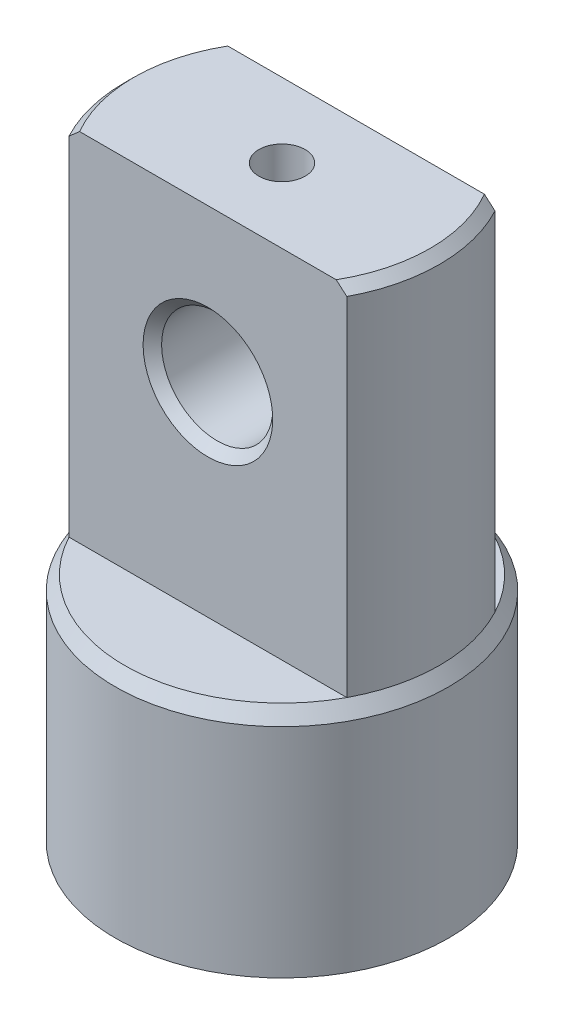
ISO-10303-21;
HEADER;
FILE_DESCRIPTION(('STEP AP214'),'2;1');
FILE_NAME('part.step','',(''),(''),'','','');
FILE_SCHEMA(('AUTOMOTIVE_DESIGN { 1 0 10303 214 1 1 1 1 }'));
ENDSEC;
DATA;
#1=APPLICATION_CONTEXT('core data for automotive mechanical design processes');
#2=APPLICATION_PROTOCOL_DEFINITION('international standard','automotive_design',2000,#1);
#3=PRODUCT_CONTEXT('',#1,'mechanical');
#4=PRODUCT('Part','Part','',(#3));
#5=PRODUCT_RELATED_PRODUCT_CATEGORY('part','',(#4));
#6=PRODUCT_DEFINITION_FORMATION('','',#4);
#7=PRODUCT_DEFINITION_CONTEXT('part definition',#1,'design');
#8=PRODUCT_DEFINITION('design','',#6,#7);
#9=PRODUCT_DEFINITION_SHAPE('','',#8);
#10=(LENGTH_UNIT() NAMED_UNIT(*) SI_UNIT(.MILLI.,.METRE.));
#11=(NAMED_UNIT(*) PLANE_ANGLE_UNIT() SI_UNIT($,.RADIAN.));
#12=(NAMED_UNIT(*) SI_UNIT($,.STERADIAN.) SOLID_ANGLE_UNIT());
#13=UNCERTAINTY_MEASURE_WITH_UNIT(LENGTH_MEASURE(1.E-05),#10,'distance_accuracy_value','');
#14=(GEOMETRIC_REPRESENTATION_CONTEXT(3) GLOBAL_UNCERTAINTY_ASSIGNED_CONTEXT((#13)) GLOBAL_UNIT_ASSIGNED_CONTEXT((#10,
#11,#12)) REPRESENTATION_CONTEXT('',''));
#15=CARTESIAN_POINT('',(0.,0.,0.));
#16=DIRECTION('',(0.,0.,1.));
#17=DIRECTION('',(1.,0.,0.));
#18=AXIS2_PLACEMENT_3D('',#15,#16,#17);
#19=CARTESIAN_POINT('',(-16.1245154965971,25.,8.));
#20=DIRECTION('',(0.,0.,-1.));
#21=DIRECTION('',(-1.,0.,0.));
#22=AXIS2_PLACEMENT_3D('',#19,#20,#21);
#23=PLANE('',#22);
#24=CARTESIAN_POINT('',(0.,47.,8.));
#25=DIRECTION('',(0.,0.,-1.));
#26=DIRECTION('',(-1.,0.,0.));
#27=AXIS2_PLACEMENT_3D('',#24,#25,#26);
#28=CIRCLE('',#27,6.99999999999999);
#29=CARTESIAN_POINT('',(-6.99999999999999,47.,8.));
#30=VERTEX_POINT('',#29);
#31=EDGE_CURVE('E11',#30,#30,#28,.T.);
#32=ORIENTED_EDGE('',*,*,#31,.T.);
#33=EDGE_LOOP('',(#32));
#34=FACE_BOUND('',#33,.T.);
#35=DIRECTION('',(0.,-1.,0.));
#36=VECTOR('',#35,1.);
#37=CARTESIAN_POINT('',(15.,0.,8.));
#38=LINE('',#37,#36);
#39=CARTESIAN_POINT('',(15.,25.,8.));
#40=VERTEX_POINT('',#39);
#41=CARTESIAN_POINT('',(15.,62.5,8.));
#42=VERTEX_POINT('',#41);
#43=EDGE_CURVE('E101',#40,#42,#38,.F.);
#44=ORIENTED_EDGE('',*,*,#43,.T.);
#45=CARTESIAN_POINT('',(15.,62.5,8.));
#46=CARTESIAN_POINT('',(14.9050732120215,62.5837587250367,8.));
#47=CARTESIAN_POINT('',(14.8100592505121,62.6674187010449,8.));
#48=CARTESIAN_POINT('',(14.6198485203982,62.8345295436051,8.));
#49=CARTESIAN_POINT('',(14.5246517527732,62.917980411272,8.));
#50=CARTESIAN_POINT('',(14.3340658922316,63.0846623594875,8.));
#51=CARTESIAN_POINT('',(14.2386767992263,63.1678934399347,8.));
#52=CARTESIAN_POINT('',(14.0476959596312,63.3341237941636,8.));
#53=CARTESIAN_POINT('',(13.9521042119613,63.4171230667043,8.));
#54=CARTESIAN_POINT('',(13.856406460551,63.5,8.));
#55=B_SPLINE_CURVE_WITH_KNOTS('',3,(#45,#46,#47,#48,#49,#50,#51,#52,#53,#54),.UNSPECIFIED.,.F.,
.F.,(4,2,2,2,4),(0.,0.379788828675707,0.759575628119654,1.13936260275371,1.51915160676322),.UNSPECIFIED.);
#56=CARTESIAN_POINT('',(13.856406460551,63.5,8.));
#57=VERTEX_POINT('',#56);
#58=EDGE_CURVE('E143',#42,#57,#55,.T.);
#59=ORIENTED_EDGE('',*,*,#58,.T.);
#60=DIRECTION('',(-1.,0.,0.));
#61=VECTOR('',#60,1.);
#62=CARTESIAN_POINT('',(17.,63.5,8.));
#63=LINE('',#62,#61);
#64=CARTESIAN_POINT('',(-13.856406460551,63.5,8.));
#65=VERTEX_POINT('',#64);
#66=EDGE_CURVE('E132',#57,#65,#63,.T.);
#67=ORIENTED_EDGE('',*,*,#66,.T.);
#68=CARTESIAN_POINT('',(-13.856406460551,63.5,8.));
#69=CARTESIAN_POINT('',(-13.9521042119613,63.4171230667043,8.));
#70=CARTESIAN_POINT('',(-14.0476959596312,63.3341237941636,8.));
#71=CARTESIAN_POINT('',(-14.2386767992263,63.1678934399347,8.));
#72=CARTESIAN_POINT('',(-14.3340658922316,63.0846623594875,8.));
#73=CARTESIAN_POINT('',(-14.5246517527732,62.917980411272,8.));
#74=CARTESIAN_POINT('',(-14.6198485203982,62.8345295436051,8.));
#75=CARTESIAN_POINT('',(-14.8100592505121,62.6674187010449,8.));
#76=CARTESIAN_POINT('',(-14.9050732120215,62.5837587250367,8.));
#77=CARTESIAN_POINT('',(-15.,62.5,8.));
#78=B_SPLINE_CURVE_WITH_KNOTS('',3,(#68,#69,#70,#71,#72,#73,#74,#75,#76,#77),.UNSPECIFIED.,.F.,
.F.,(4,2,2,2,4),(0.,0.379789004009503,0.759575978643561,1.13936277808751,1.51915160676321),.UNSPECIFIED.);
#79=CARTESIAN_POINT('',(-15.,62.5,8.));
#80=VERTEX_POINT('',#79);
#81=EDGE_CURVE('E136',#65,#80,#78,.T.);
#82=ORIENTED_EDGE('',*,*,#81,.T.);
#83=DIRECTION('',(0.,-1.,0.));
#84=VECTOR('',#83,1.);
#85=CARTESIAN_POINT('',(-15.,0.,8.));
#86=LINE('',#85,#84);
#87=CARTESIAN_POINT('',(-15.,25.,8.));
#88=VERTEX_POINT('',#87);
#89=EDGE_CURVE('E103',#80,#88,#86,.T.);
#90=ORIENTED_EDGE('',*,*,#89,.T.);
#91=DIRECTION('',(-1.,0.,0.));
#92=VECTOR('',#91,1.);
#93=CARTESIAN_POINT('',(-16.1245154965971,25.,8.));
#94=LINE('',#93,#92);
#95=EDGE_CURVE('E91',#40,#88,#94,.T.);
#96=ORIENTED_EDGE('',*,*,#95,.F.);
#97=EDGE_LOOP('',(#44,#59,#67,#82,#90,#96));
#98=FACE_BOUND('',#97,.T.);
#99=ADVANCED_FACE('F32',(#34,#98),#23,.F.);
#100=CARTESIAN_POINT('',(0.,0.,0.));
#101=DIRECTION('',(0.,-1.,0.));
#102=DIRECTION('',(1.,0.,0.));
#103=AXIS2_PLACEMENT_3D('',#100,#101,#102);
#104=CYLINDRICAL_SURFACE('',#103,17.);
#105=DIRECTION('',(0.,-1.,0.));
#106=VECTOR('',#105,1.);
#107=CARTESIAN_POINT('',(15.,0.,-8.));
#108=LINE('',#107,#106);
#109=CARTESIAN_POINT('',(15.,62.5,-8.));
#110=VERTEX_POINT('',#109);
#111=CARTESIAN_POINT('',(15.,25.,-8.));
#112=VERTEX_POINT('',#111);
#113=EDGE_CURVE('E324',#110,#112,#108,.T.);
#114=ORIENTED_EDGE('',*,*,#113,.F.);
#115=CARTESIAN_POINT('',(0.,62.5,0.));
#116=DIRECTION('',(0.,1.,0.));
#117=DIRECTION('',(-1.,0.,0.));
#118=AXIS2_PLACEMENT_3D('',#115,#116,#117);
#119=CIRCLE('',#118,17.);
#120=EDGE_CURVE('E113',#110,#42,#119,.F.);
#121=ORIENTED_EDGE('',*,*,#120,.T.);
#122=ORIENTED_EDGE('',*,*,#43,.F.);
#123=CARTESIAN_POINT('',(0.,25.,0.));
#124=DIRECTION('',(0.,-1.,0.));
#125=DIRECTION('',(1.,0.,0.));
#126=AXIS2_PLACEMENT_3D('',#123,#124,#125);
#127=CIRCLE('',#126,17.);
#128=EDGE_CURVE('E95',#112,#40,#127,.T.);
#129=ORIENTED_EDGE('',*,*,#128,.F.);
#130=EDGE_LOOP('',(#114,#121,#122,#129));
#131=FACE_BOUND('',#130,.T.);
#132=ADVANCED_FACE('F110',(#131),#104,.T.);
#133=CARTESIAN_POINT('',(0.,0.,0.));
#134=DIRECTION('',(0.,-1.,0.));
#135=DIRECTION('',(1.,0.,0.));
#136=AXIS2_PLACEMENT_3D('',#133,#134,#135);
#137=PLANE('',#136);
#138=CARTESIAN_POINT('',(0.,0.,0.));
#139=DIRECTION('',(0.,-1.,0.));
#140=DIRECTION('',(1.,0.,0.));
#141=AXIS2_PLACEMENT_3D('',#138,#139,#140);
#142=CIRCLE('',#141,18.);
#143=CARTESIAN_POINT('',(18.,0.,0.));
#144=VERTEX_POINT('',#143);
#145=EDGE_CURVE('E127',#144,#144,#142,.T.);
#146=ORIENTED_EDGE('',*,*,#145,.T.);
#147=EDGE_LOOP('',(#146));
#148=FACE_BOUND('',#147,.T.);
#149=ADVANCED_FACE('F188',(#148),#137,.T.);
#150=CARTESIAN_POINT('',(0.,0.,0.));
#151=DIRECTION('',(0.,-1.,0.));
#152=DIRECTION('',(1.,0.,0.));
#153=AXIS2_PLACEMENT_3D('',#150,#151,#152);
#154=CYLINDRICAL_SURFACE('',#153,18.);
#155=CARTESIAN_POINT('',(0.,23.5,0.));
#156=DIRECTION('',(0.,-1.,0.));
#157=DIRECTION('',(1.,0.,0.));
#158=AXIS2_PLACEMENT_3D('',#155,#156,#157);
#159=CIRCLE('',#158,18.);
#160=CARTESIAN_POINT('',(18.,23.5,0.));
#161=VERTEX_POINT('',#160);
#162=EDGE_CURVE('E120',#161,#161,#159,.T.);
#163=ORIENTED_EDGE('',*,*,#162,.T.);
#164=EDGE_LOOP('',(#163));
#165=FACE_BOUND('',#164,.T.);
#166=ORIENTED_EDGE('',*,*,#145,.F.);
#167=EDGE_LOOP('',(#166));
#168=FACE_BOUND('',#167,.T.);
#169=ADVANCED_FACE('F192',(#165,#168),#154,.T.);
#170=CARTESIAN_POINT('',(0.,23.5,0.));
#171=DIRECTION('',(0.,-1.,0.));
#172=DIRECTION('',(1.,0.,0.));
#173=AXIS2_PLACEMENT_3D('',#170,#171,#172);
#174=CONICAL_SURFACE('',#173,18.,0.588002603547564);
#175=CARTESIAN_POINT('',(-15.,25.,-8.));
#176=VERTEX_POINT('',#175);
#177=EDGE_CURVE('E119',#176,#112,#127,.T.);
#178=ORIENTED_EDGE('',*,*,#177,.T.);
#179=ORIENTED_EDGE('',*,*,#128,.T.);
#180=EDGE_CURVE('E88',#40,#88,#127,.T.);
#181=ORIENTED_EDGE('',*,*,#180,.T.);
#182=EDGE_CURVE('E96',#88,#176,#127,.T.);
#183=ORIENTED_EDGE('',*,*,#182,.T.);
#184=EDGE_LOOP('',(#178,#179,#181,#183));
#185=FACE_BOUND('',#184,.T.);
#186=ORIENTED_EDGE('',*,*,#162,.F.);
#187=EDGE_LOOP('',(#186));
#188=FACE_BOUND('',#187,.T.);
#189=ADVANCED_FACE('F116',(#185,#188),#174,.T.);
#190=ORIENTED_EDGE('',*,*,#89,.F.);
#191=CARTESIAN_POINT('',(0.,62.5,0.));
#192=DIRECTION('',(0.,1.,0.));
#193=DIRECTION('',(-1.,0.,0.));
#194=AXIS2_PLACEMENT_3D('',#191,#192,#193);
#195=CIRCLE('',#194,17.);
#196=CARTESIAN_POINT('',(-15.,62.5,-8.));
#197=VERTEX_POINT('',#196);
#198=EDGE_CURVE('E181',#80,#197,#195,.F.);
#199=ORIENTED_EDGE('',*,*,#198,.T.);
#200=DIRECTION('',(0.,-1.,0.));
#201=VECTOR('',#200,1.);
#202=CARTESIAN_POINT('',(-15.,0.,-8.));
#203=LINE('',#202,#201);
#204=EDGE_CURVE('E123',#176,#197,#203,.F.);
#205=ORIENTED_EDGE('',*,*,#204,.F.);
#206=ORIENTED_EDGE('',*,*,#182,.F.);
#207=EDGE_LOOP('',(#190,#199,#205,#206));
#208=FACE_BOUND('',#207,.T.);
#209=ADVANCED_FACE('F198',(#208),#104,.T.);
#210=CARTESIAN_POINT('',(17.,63.5,0.));
#211=DIRECTION('',(0.,1.,0.));
#212=DIRECTION('',(-1.,0.,0.));
#213=AXIS2_PLACEMENT_3D('',#210,#211,#212);
#214=PLANE('',#213);
#215=CARTESIAN_POINT('',(0.,63.5,0.));
#216=DIRECTION('',(0.,1.,0.));
#217=DIRECTION('',(0.,0.,1.));
#218=AXIS2_PLACEMENT_3D('',#215,#216,#217);
#219=CIRCLE('',#218,2.5);
#220=CARTESIAN_POINT('',(0.,63.5,2.5));
#221=VERTEX_POINT('',#220);
#222=EDGE_CURVE('E320',#221,#221,#219,.T.);
#223=ORIENTED_EDGE('',*,*,#222,.F.);
#224=EDGE_LOOP('',(#223));
#225=FACE_BOUND('',#224,.T.);
#226=ORIENTED_EDGE('',*,*,#66,.F.);
#227=CARTESIAN_POINT('',(0.,63.5,0.));
#228=DIRECTION('',(0.,1.,0.));
#229=DIRECTION('',(-1.,0.,0.));
#230=AXIS2_PLACEMENT_3D('',#227,#228,#229);
#231=CIRCLE('',#230,16.);
#232=CARTESIAN_POINT('',(13.856406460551,63.5,-8.));
#233=VERTEX_POINT('',#232);
#234=EDGE_CURVE('E55',#57,#233,#231,.T.);
#235=ORIENTED_EDGE('',*,*,#234,.T.);
#236=DIRECTION('',(1.,0.,0.));
#237=VECTOR('',#236,1.);
#238=CARTESIAN_POINT('',(17.,63.5,-8.));
#239=LINE('',#238,#237);
#240=CARTESIAN_POINT('',(-13.856406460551,63.5,-8.));
#241=VERTEX_POINT('',#240);
#242=EDGE_CURVE('E130',#241,#233,#239,.T.);
#243=ORIENTED_EDGE('',*,*,#242,.F.);
#244=CARTESIAN_POINT('',(0.,63.5,0.));
#245=DIRECTION('',(0.,1.,0.));
#246=DIRECTION('',(-1.,0.,0.));
#247=AXIS2_PLACEMENT_3D('',#244,#245,#246);
#248=CIRCLE('',#247,16.);
#249=EDGE_CURVE('E343',#241,#65,#248,.T.);
#250=ORIENTED_EDGE('',*,*,#249,.T.);
#251=EDGE_LOOP('',(#226,#235,#243,#250));
#252=FACE_BOUND('',#251,.T.);
#253=ADVANCED_FACE('F166',(#225,#252),#214,.T.);
#254=CARTESIAN_POINT('',(-16.1245154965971,25.,-8.));
#255=DIRECTION('',(0.,0.,1.));
#256=DIRECTION('',(1.,0.,0.));
#257=AXIS2_PLACEMENT_3D('',#254,#255,#256);
#258=PLANE('',#257);
#259=CARTESIAN_POINT('',(0.,47.,-8.));
#260=DIRECTION('',(0.,0.,1.));
#261=DIRECTION('',(1.,0.,0.));
#262=AXIS2_PLACEMENT_3D('',#259,#260,#261);
#263=CIRCLE('',#262,6.99999999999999);
#264=CARTESIAN_POINT('',(6.99999999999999,47.,-8.));
#265=VERTEX_POINT('',#264);
#266=EDGE_CURVE('E330',#265,#265,#263,.T.);
#267=ORIENTED_EDGE('',*,*,#266,.T.);
#268=EDGE_LOOP('',(#267));
#269=FACE_BOUND('',#268,.T.);
#270=ORIENTED_EDGE('',*,*,#242,.T.);
#271=CARTESIAN_POINT('',(13.856406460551,63.5,-8.));
#272=CARTESIAN_POINT('',(13.9521042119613,63.4171230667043,-8.));
#273=CARTESIAN_POINT('',(14.0476959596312,63.3341237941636,-8.));
#274=CARTESIAN_POINT('',(14.2386767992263,63.1678934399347,-8.));
#275=CARTESIAN_POINT('',(14.3340658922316,63.0846623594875,-8.));
#276=CARTESIAN_POINT('',(14.5246517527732,62.917980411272,-8.));
#277=CARTESIAN_POINT('',(14.6198485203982,62.8345295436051,-8.));
#278=CARTESIAN_POINT('',(14.8100592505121,62.6674187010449,-8.));
#279=CARTESIAN_POINT('',(14.9050732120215,62.5837587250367,-8.));
#280=CARTESIAN_POINT('',(15.,62.5,-8.));
#281=B_SPLINE_CURVE_WITH_KNOTS('',3,(#271,#272,#273,#274,#275,#276,#277,#278,#279,#280),
.UNSPECIFIED.,.F.,.F.,(4,2,2,2,4),(0.,0.379789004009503,0.759575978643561,1.13936277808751,
1.51915160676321),.UNSPECIFIED.);
#282=EDGE_CURVE('E176',#233,#110,#281,.T.);
#283=ORIENTED_EDGE('',*,*,#282,.T.);
#284=ORIENTED_EDGE('',*,*,#113,.T.);
#285=DIRECTION('',(1.,0.,0.));
#286=VECTOR('',#285,1.);
#287=CARTESIAN_POINT('',(-16.1245154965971,25.,-8.));
#288=LINE('',#287,#286);
#289=EDGE_CURVE('E114',#176,#112,#288,.T.);
#290=ORIENTED_EDGE('',*,*,#289,.F.);
#291=ORIENTED_EDGE('',*,*,#204,.T.);
#292=CARTESIAN_POINT('',(-15.,62.5,-8.));
#293=CARTESIAN_POINT('',(-14.9050732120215,62.5837587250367,-8.));
#294=CARTESIAN_POINT('',(-14.8100592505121,62.6674187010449,-8.));
#295=CARTESIAN_POINT('',(-14.6198485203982,62.8345295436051,-8.));
#296=CARTESIAN_POINT('',(-14.5246517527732,62.917980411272,-8.));
#297=CARTESIAN_POINT('',(-14.3340658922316,63.0846623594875,-8.));
#298=CARTESIAN_POINT('',(-14.2386767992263,63.1678934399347,-8.));
#299=CARTESIAN_POINT('',(-14.0476959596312,63.3341237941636,-8.));
#300=CARTESIAN_POINT('',(-13.9521042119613,63.4171230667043,-8.));
#301=CARTESIAN_POINT('',(-13.856406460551,63.5,-8.));
#302=B_SPLINE_CURVE_WITH_KNOTS('',3,(#292,#293,#294,#295,#296,#297,#298,#299,#300,#301),
.UNSPECIFIED.,.F.,.F.,(4,2,2,2,4),(0.,0.379788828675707,0.759575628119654,1.13936260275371,
1.51915160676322),.UNSPECIFIED.);
#303=EDGE_CURVE('E47',#197,#241,#302,.T.);
#304=ORIENTED_EDGE('',*,*,#303,.T.);
#305=EDGE_LOOP('',(#270,#283,#284,#290,#291,#304));
#306=FACE_BOUND('',#305,.T.);
#307=ADVANCED_FACE('F161',(#269,#306),#258,.F.);
#308=CARTESIAN_POINT('',(0.,25.,0.));
#309=DIRECTION('',(0.,1.,0.));
#310=DIRECTION('',(0.,0.,1.));
#311=AXIS2_PLACEMENT_3D('',#308,#309,#310);
#312=PLANE('',#311);
#313=ORIENTED_EDGE('',*,*,#289,.T.);
#314=ORIENTED_EDGE('',*,*,#177,.F.);
#315=EDGE_LOOP('',(#313,#314));
#316=FACE_BOUND('',#315,.T.);
#317=ADVANCED_FACE('F157',(#316),#312,.T.);
#318=CARTESIAN_POINT('',(0.,25.,0.));
#319=DIRECTION('',(0.,1.,0.));
#320=DIRECTION('',(0.,0.,1.));
#321=AXIS2_PLACEMENT_3D('',#318,#319,#320);
#322=PLANE('',#321);
#323=ORIENTED_EDGE('',*,*,#95,.T.);
#324=ORIENTED_EDGE('',*,*,#180,.F.);
#325=EDGE_LOOP('',(#323,#324));
#326=FACE_BOUND('',#325,.T.);
#327=ADVANCED_FACE('F90',(#326),#322,.T.);
#328=CARTESIAN_POINT('',(0.,62.5,0.));
#329=DIRECTION('',(0.,-1.,0.));
#330=DIRECTION('',(1.,0.,0.));
#331=AXIS2_PLACEMENT_3D('',#328,#329,#330);
#332=CONICAL_SURFACE('',#331,17.,0.785398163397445);
#333=ORIENTED_EDGE('',*,*,#282,.F.);
#334=ORIENTED_EDGE('',*,*,#234,.F.);
#335=ORIENTED_EDGE('',*,*,#58,.F.);
#336=ORIENTED_EDGE('',*,*,#120,.F.);
#337=EDGE_LOOP('',(#333,#334,#335,#336));
#338=FACE_BOUND('',#337,.T.);
#339=ADVANCED_FACE('F183',(#338),#332,.T.);
#340=CARTESIAN_POINT('',(0.,62.5,0.));
#341=DIRECTION('',(0.,-1.,0.));
#342=DIRECTION('',(1.,0.,0.));
#343=AXIS2_PLACEMENT_3D('',#340,#341,#342);
#344=CONICAL_SURFACE('',#343,17.,0.785398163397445);
#345=ORIENTED_EDGE('',*,*,#81,.F.);
#346=ORIENTED_EDGE('',*,*,#249,.F.);
#347=ORIENTED_EDGE('',*,*,#303,.F.);
#348=ORIENTED_EDGE('',*,*,#198,.F.);
#349=EDGE_LOOP('',(#345,#346,#347,#348));
#350=FACE_BOUND('',#349,.T.);
#351=ADVANCED_FACE('F149',(#350),#344,.T.);
#352=CARTESIAN_POINT('',(0.,47.,8.));
#353=DIRECTION('',(0.,0.,1.));
#354=DIRECTION('',(1.,0.,0.));
#355=AXIS2_PLACEMENT_3D('',#352,#353,#354);
#356=CYLINDRICAL_SURFACE('',#355,6.);
#357=CARTESIAN_POINT('',(0.,53.,2.5));
#358=CARTESIAN_POINT('',(0.13390391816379,52.9999962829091,2.4999952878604));
#359=CARTESIAN_POINT('',(0.268039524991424,52.9954665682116,2.48917868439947));
#360=CARTESIAN_POINT('',(0.532498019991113,52.9778011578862,2.44631926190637));
#361=CARTESIAN_POINT('',(0.662810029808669,52.9646430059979,2.41422105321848));
#362=CARTESIAN_POINT('',(0.915376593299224,52.9311262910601,2.3301785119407));
#363=CARTESIAN_POINT('',(1.03765681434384,52.9107921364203,2.27830140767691));
#364=CARTESIAN_POINT('',(1.27165974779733,52.8649055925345,2.15645416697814));
#365=CARTESIAN_POINT('',(1.38338564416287,52.8393547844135,2.08648951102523));
#366=CARTESIAN_POINT('',(1.59889674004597,52.7841566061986,1.92674208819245));
#367=CARTESIAN_POINT('',(1.70208251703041,52.7543750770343,1.8361973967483));
#368=CARTESIAN_POINT('',(1.8923196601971,52.6946542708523,1.63947131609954));
#369=CARTESIAN_POINT('',(1.9793625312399,52.6647149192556,1.53328174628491));
#370=CARTESIAN_POINT('',(2.13907474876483,52.6064204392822,1.30194644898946));
#371=CARTESIAN_POINT('',(2.2108261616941,52.578215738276,1.17612510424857));
#372=CARTESIAN_POINT('',(2.331878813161,52.5287114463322,0.912853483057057));
#373=CARTESIAN_POINT('',(2.38119161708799,52.507408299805,0.775409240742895));
#374=CARTESIAN_POINT('',(2.45349196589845,52.4755711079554,0.499692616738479));
#375=CARTESIAN_POINT('',(2.47763315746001,52.4645677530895,0.361779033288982));
#376=CARTESIAN_POINT('',(2.50250419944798,52.4532265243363,0.0834534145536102));
#377=CARTESIAN_POINT('',(2.5032469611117,52.4528827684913,-0.0569572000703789));
#378=CARTESIAN_POINT('',(2.48216900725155,52.4625023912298,-0.324800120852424));
#379=CARTESIAN_POINT('',(2.46207362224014,52.4716776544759,-0.452402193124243));
#380=CARTESIAN_POINT('',(2.40278382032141,52.4979696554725,-0.702224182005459));
#381=CARTESIAN_POINT('',(2.36358574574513,52.5150879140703,-0.824443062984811));
#382=CARTESIAN_POINT('',(2.26643917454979,52.5557236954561,-1.06311540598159));
#383=CARTESIAN_POINT('',(2.20810943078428,52.579369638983,-1.17939084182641));
#384=CARTESIAN_POINT('',(2.07462485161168,52.6303666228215,-1.40095546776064));
#385=CARTESIAN_POINT('',(1.99946338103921,52.6577191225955,-1.50624030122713));
#386=CARTESIAN_POINT('',(1.82699193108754,52.7158595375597,-1.71219991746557));
#387=CARTESIAN_POINT('',(1.72834696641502,52.7467424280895,-1.81173313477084));
#388=CARTESIAN_POINT('',(1.51545918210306,52.8065134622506,-1.99322700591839));
#389=CARTESIAN_POINT('',(1.40121271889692,52.8354011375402,-2.07518354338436));
#390=CARTESIAN_POINT('',(1.15689589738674,52.8887656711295,-2.22087164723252));
#391=CARTESIAN_POINT('',(1.02652116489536,52.9131253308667,-2.28413889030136));
#392=CARTESIAN_POINT('',(0.755704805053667,52.9537896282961,-2.38744227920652));
#393=CARTESIAN_POINT('',(0.615268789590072,52.970098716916,-2.42749126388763));
#394=CARTESIAN_POINT('',(0.337856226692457,52.9919928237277,-2.48083198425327));
#395=CARTESIAN_POINT('',(0.20122257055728,52.9981908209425,-2.4956557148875));
#396=CARTESIAN_POINT('',(-0.0727093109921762,53.0011210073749,-2.50269244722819));
#397=CARTESIAN_POINT('',(-0.210007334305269,52.9978559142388,-2.494911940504));
#398=CARTESIAN_POINT('',(-0.474196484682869,52.9826243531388,-2.45805783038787));
#399=CARTESIAN_POINT('',(-0.601265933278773,52.9710977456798,-2.43006009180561));
#400=CARTESIAN_POINT('',(-0.848765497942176,52.9409721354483,-2.35506361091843));
#401=CARTESIAN_POINT('',(-0.96919477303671,52.9223722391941,-2.30806246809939));
#402=CARTESIAN_POINT('',(-1.20421799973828,52.8791654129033,-2.19485804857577));
#403=CARTESIAN_POINT('',(-1.31851447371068,52.8543898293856,-2.12810363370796));
#404=CARTESIAN_POINT('',(-1.53469243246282,52.8014760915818,-1.97789324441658));
#405=CARTESIAN_POINT('',(-1.63656870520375,52.7733365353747,-1.89443029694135));
#406=CARTESIAN_POINT('',(-1.83266686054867,52.7142417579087,-1.70619353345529));
#407=CARTESIAN_POINT('',(-1.92582139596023,52.6832290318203,-1.60032299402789));
#408=CARTESIAN_POINT('',(-2.09333969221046,52.6236867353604,-1.3739574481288));
#409=CARTESIAN_POINT('',(-2.16769918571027,52.5951577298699,-1.25345912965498));
#410=CARTESIAN_POINT('',(-2.29631920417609,52.5436277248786,-0.998771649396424));
#411=CARTESIAN_POINT('',(-2.35027836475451,52.520711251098,-0.864411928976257));
#412=CARTESIAN_POINT('',(-2.43434827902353,52.4841671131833,-0.587258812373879));
#413=CARTESIAN_POINT('',(-2.46447869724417,52.4705317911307,-0.444472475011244));
#414=CARTESIAN_POINT('',(-2.49808160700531,52.4552632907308,-0.166362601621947));
#415=CARTESIAN_POINT('',(-2.50342760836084,52.4527870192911,-0.0313106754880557));
#416=CARTESIAN_POINT('',(-2.49231151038,52.4578770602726,0.237685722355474));
#417=CARTESIAN_POINT('',(-2.47585275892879,52.4654418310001,0.3716303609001));
#418=CARTESIAN_POINT('',(-2.42316809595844,52.4889910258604,0.628185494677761));
#419=CARTESIAN_POINT('',(-2.38789807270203,52.5045670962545,0.751033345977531));
#420=CARTESIAN_POINT('',(-2.29952656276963,52.542063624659,0.989096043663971));
#421=CARTESIAN_POINT('',(-2.24642006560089,52.5639858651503,1.104308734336));
#422=CARTESIAN_POINT('',(-2.1202057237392,52.6133390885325,1.33139178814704));
#423=CARTESIAN_POINT('',(-2.04608723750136,52.6410220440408,1.44264464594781));
#424=CARTESIAN_POINT('',(-1.88136812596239,52.6980737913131,1.65172029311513));
#425=CARTESIAN_POINT('',(-1.79076178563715,52.7274431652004,1.74953840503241));
#426=CARTESIAN_POINT('',(-1.58780416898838,52.7871278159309,1.93629730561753));
#427=CARTESIAN_POINT('',(-1.47434977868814,52.8173561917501,2.0240726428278));
#428=CARTESIAN_POINT('',(-1.23319985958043,52.8732030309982,2.17939913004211));
#429=CARTESIAN_POINT('',(-1.1054978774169,52.8988193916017,2.24694106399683));
#430=CARTESIAN_POINT('',(-0.841465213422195,52.942183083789,2.3584188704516));
#431=CARTESIAN_POINT('',(-0.705312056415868,52.9600534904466,2.40272649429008));
#432=CARTESIAN_POINT('',(-0.426816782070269,52.9864223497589,2.46741568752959));
#433=CARTESIAN_POINT('',(-0.284495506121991,52.9949501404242,2.48787216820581));
#434=CARTESIAN_POINT('',(-0.118052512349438,52.9988856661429,2.49732384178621));
#435=CARTESIAN_POINT('',(-0.0944569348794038,52.99930292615,2.49832660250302));
#436=CARTESIAN_POINT('',(-0.0472433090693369,52.9998604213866,2.49966509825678));
#437=CARTESIAN_POINT('',(-0.0236252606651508,53.0000006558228,2.50000083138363));
#438=CARTESIAN_POINT('',(0.,53.,2.5));
#439=B_SPLINE_CURVE_WITH_KNOTS('',3,(#357,#358,#359,#360,#361,#362,#363,#364,#365,#366,#367,
#368,#369,#370,#371,#372,#373,#374,#375,#376,#377,#378,#379,#380,#381,#382,#383,#384,#385,#386,
#387,#388,#389,#390,#391,#392,#393,#394,#395,#396,#397,#398,#399,#400,#401,#402,#403,#404,#405,
#406,#407,#408,#409,#410,#411,#412,#413,#414,#415,#416,#417,#418,#419,#420,#421,#422,#423,#424,
#425,#426,#427,#428,#429,#430,#431,#432,#433,#434,#435,#436,#437,#438),.UNSPECIFIED.,.T.,.F.,(4,
2,2,2,2,2,2,2,2,2,2,2,2,2,2,2,2,2,2,2,2,2,2,2,2,2,2,2,2,2,2,2,2,2,2,2,2,2,2,2,4),(0.,
0.401613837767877,0.804277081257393,1.2055837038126,1.60676887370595,2.02635872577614,
2.44616876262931,2.8866344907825,3.32687293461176,3.74590546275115,4.16470676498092,
4.55140314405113,4.93817359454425,5.33317426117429,5.72833091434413,6.15688282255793,
6.58553498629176,7.02408110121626,7.46238448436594,7.87296886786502,8.28343534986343,
8.67353179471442,9.0636775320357,9.46594270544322,9.86837610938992,10.2995697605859,
10.7308612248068,11.1682957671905,11.6053689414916,12.0087975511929,12.4121642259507,
12.7967529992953,13.1814498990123,13.5892778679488,13.9972474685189,14.4349307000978,
14.8728129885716,15.3034571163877,15.7327450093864,15.8036033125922,15.8744618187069),.UNSPECIFIED.);
#440=CARTESIAN_POINT('',(0.,53.,2.5));
#441=VERTEX_POINT('',#440);
#442=EDGE_CURVE('E104',#441,#441,#439,.T.);
#443=ORIENTED_EDGE('',*,*,#442,.T.);
#444=EDGE_LOOP('',(#443));
#445=FACE_BOUND('',#444,.T.);
#446=CARTESIAN_POINT('',(0.,47.,-7.));
#447=DIRECTION('',(0.,0.,1.));
#448=DIRECTION('',(1.,0.,0.));
#449=AXIS2_PLACEMENT_3D('',#446,#447,#448);
#450=CIRCLE('',#449,6.);
#451=CARTESIAN_POINT('',(6.,47.,-7.));
#452=VERTEX_POINT('',#451);
#453=EDGE_CURVE('E40',#452,#452,#450,.F.);
#454=ORIENTED_EDGE('',*,*,#453,.T.);
#455=EDGE_LOOP('',(#454));
#456=FACE_BOUND('',#455,.T.);
#457=CARTESIAN_POINT('',(0.,47.,7.00000000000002));
#458=DIRECTION('',(0.,0.,-1.));
#459=DIRECTION('',(-1.,0.,0.));
#460=AXIS2_PLACEMENT_3D('',#457,#458,#459);
#461=CIRCLE('',#460,6.);
#462=CARTESIAN_POINT('',(-6.,47.,7.00000000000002));
#463=VERTEX_POINT('',#462);
#464=EDGE_CURVE('E332',#463,#463,#461,.F.);
#465=ORIENTED_EDGE('',*,*,#464,.T.);
#466=EDGE_LOOP('',(#465));
#467=FACE_BOUND('',#466,.T.);
#468=ADVANCED_FACE('F249',(#445,#456,#467),#356,.F.);
#469=CARTESIAN_POINT('',(0.,47.,-8.));
#470=DIRECTION('',(0.,0.,-1.));
#471=DIRECTION('',(-1.,0.,0.));
#472=AXIS2_PLACEMENT_3D('',#469,#470,#471);
#473=CONICAL_SURFACE('',#472,6.99999999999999,0.785398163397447);
#474=ORIENTED_EDGE('',*,*,#453,.F.);
#475=EDGE_LOOP('',(#474));
#476=FACE_BOUND('',#475,.T.);
#477=ORIENTED_EDGE('',*,*,#266,.F.);
#478=EDGE_LOOP('',(#477));
#479=FACE_BOUND('',#478,.T.);
#480=ADVANCED_FACE('F255',(#476,#479),#473,.F.);
#481=CARTESIAN_POINT('',(0.,47.,7.00000000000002));
#482=DIRECTION('',(0.,0.,1.));
#483=DIRECTION('',(1.,0.,0.));
#484=AXIS2_PLACEMENT_3D('',#481,#482,#483);
#485=CONICAL_SURFACE('',#484,6.,0.785398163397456);
#486=ORIENTED_EDGE('',*,*,#31,.F.);
#487=EDGE_LOOP('',(#486));
#488=FACE_BOUND('',#487,.T.);
#489=ORIENTED_EDGE('',*,*,#464,.F.);
#490=EDGE_LOOP('',(#489));
#491=FACE_BOUND('',#490,.T.);
#492=ADVANCED_FACE('F34',(#488,#491),#485,.F.);
#493=CARTESIAN_POINT('',(0.,63.5,0.));
#494=DIRECTION('',(0.,1.,0.));
#495=DIRECTION('',(0.,0.,1.));
#496=AXIS2_PLACEMENT_3D('',#493,#494,#495);
#497=CYLINDRICAL_SURFACE('',#496,2.5);
#498=ORIENTED_EDGE('',*,*,#442,.F.);
#499=EDGE_LOOP('',(#498));
#500=FACE_BOUND('',#499,.T.);
#501=ORIENTED_EDGE('',*,*,#222,.T.);
#502=EDGE_LOOP('',(#501));
#503=FACE_BOUND('',#502,.T.);
#504=ADVANCED_FACE('F271',(#500,#503),#497,.F.);
#505=CLOSED_SHELL('',(#99,#132,#149,#169,#189,#209,#253,#307,#317,#327,#339,#351,#468,#480,#492,#504));
#506=MANIFOLD_SOLID_BREP('B2',#505);
#507=ADVANCED_BREP_SHAPE_REPRESENTATION('',(#18,#506),#14);
#508=SHAPE_DEFINITION_REPRESENTATION(#9,#507);
ENDSEC;
END-ISO-10303-21;
